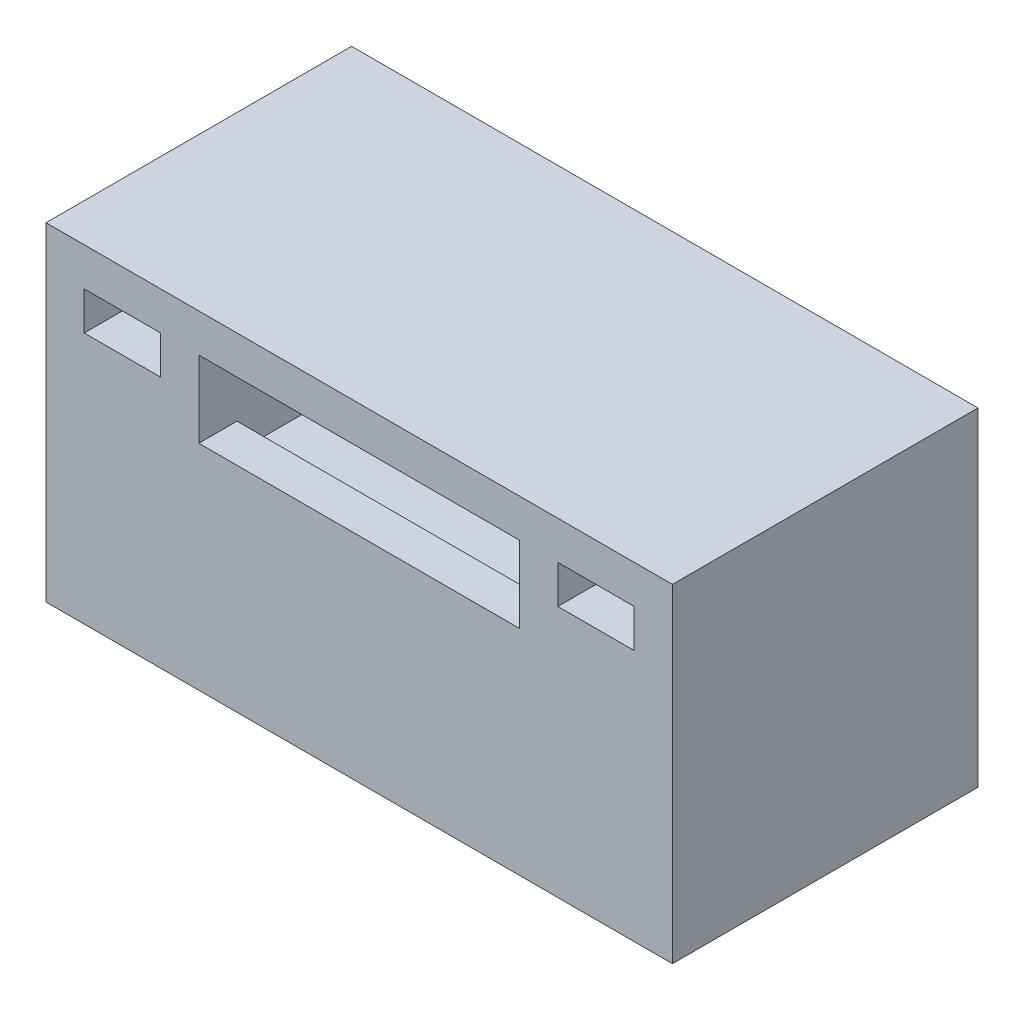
ISO-10303-21;
HEADER;
FILE_DESCRIPTION(('STEP AP214'),'2;1');
FILE_NAME('part.step','',(''),(''),'','','');
FILE_SCHEMA(('AUTOMOTIVE_DESIGN { 1 0 10303 214 1 1 1 1 }'));
ENDSEC;
DATA;
#1=APPLICATION_CONTEXT('core data for automotive mechanical design processes');
#2=APPLICATION_PROTOCOL_DEFINITION('international standard','automotive_design',2000,#1);
#3=PRODUCT_CONTEXT('',#1,'mechanical');
#4=PRODUCT('Part','Part','',(#3));
#5=PRODUCT_RELATED_PRODUCT_CATEGORY('part','',(#4));
#6=PRODUCT_DEFINITION_FORMATION('','',#4);
#7=PRODUCT_DEFINITION_CONTEXT('part definition',#1,'design');
#8=PRODUCT_DEFINITION('design','',#6,#7);
#9=PRODUCT_DEFINITION_SHAPE('','',#8);
#10=(LENGTH_UNIT() NAMED_UNIT(*) SI_UNIT(.MILLI.,.METRE.));
#11=(NAMED_UNIT(*) PLANE_ANGLE_UNIT() SI_UNIT($,.RADIAN.));
#12=(NAMED_UNIT(*) SI_UNIT($,.STERADIAN.) SOLID_ANGLE_UNIT());
#13=UNCERTAINTY_MEASURE_WITH_UNIT(LENGTH_MEASURE(1.E-05),#10,'distance_accuracy_value','');
#14=(GEOMETRIC_REPRESENTATION_CONTEXT(3) GLOBAL_UNCERTAINTY_ASSIGNED_CONTEXT((#13)) GLOBAL_UNIT_ASSIGNED_CONTEXT((#10,
#11,#12)) REPRESENTATION_CONTEXT('',''));
#15=CARTESIAN_POINT('',(0.,0.,0.));
#16=DIRECTION('',(0.,0.,1.));
#17=DIRECTION('',(1.,0.,0.));
#18=AXIS2_PLACEMENT_3D('',#15,#16,#17);
#19=CARTESIAN_POINT('',(2.1,0.300582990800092,4.));
#20=DIRECTION('',(0.,1.,0.));
#21=DIRECTION('',(-1.,0.,0.));
#22=AXIS2_PLACEMENT_3D('',#19,#20,#21);
#23=PLANE('',#22);
#24=DIRECTION('',(0.,0.,-1.));
#25=VECTOR('',#24,1.);
#26=CARTESIAN_POINT('',(-2.1,0.300582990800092,4.));
#27=LINE('',#26,#25);
#28=CARTESIAN_POINT('',(-2.1,0.300582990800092,3.5));
#29=VERTEX_POINT('',#28);
#30=CARTESIAN_POINT('',(-2.1,0.300582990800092,0.));
#31=VERTEX_POINT('',#30);
#32=EDGE_CURVE('E262',#29,#31,#27,.T.);
#33=ORIENTED_EDGE('',*,*,#32,.F.);
#34=DIRECTION('',(1.,0.,0.));
#35=VECTOR('',#34,1.);
#36=CARTESIAN_POINT('',(2.1,0.300582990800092,3.5));
#37=LINE('',#36,#35);
#38=CARTESIAN_POINT('',(2.1,0.300582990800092,3.5));
#39=VERTEX_POINT('',#38);
#40=EDGE_CURVE('E471',#29,#39,#37,.T.);
#41=ORIENTED_EDGE('',*,*,#40,.T.);
#42=DIRECTION('',(0.,0.,-1.));
#43=VECTOR('',#42,1.);
#44=CARTESIAN_POINT('',(2.1,0.300582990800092,4.));
#45=LINE('',#44,#43);
#46=CARTESIAN_POINT('',(2.1,0.300582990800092,0.));
#47=VERTEX_POINT('',#46);
#48=EDGE_CURVE('E260',#39,#47,#45,.T.);
#49=ORIENTED_EDGE('',*,*,#48,.T.);
#50=DIRECTION('',(1.,0.,0.));
#51=VECTOR('',#50,1.);
#52=CARTESIAN_POINT('',(2.1,0.300582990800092,0.));
#53=LINE('',#52,#51);
#54=EDGE_CURVE('E248',#31,#47,#53,.T.);
#55=ORIENTED_EDGE('',*,*,#54,.F.);
#56=EDGE_LOOP('',(#33,#41,#49,#55));
#57=FACE_BOUND('',#56,.T.);
#58=ADVANCED_FACE('F34',(#57),#23,.T.);
#59=CARTESIAN_POINT('',(-2.6,-0.199417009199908,4.));
#60=DIRECTION('',(-1.,0.,0.));
#61=DIRECTION('',(0.,0.,1.));
#62=AXIS2_PLACEMENT_3D('',#59,#60,#61);
#63=PLANE('',#62);
#64=DIRECTION('',(0.,0.,-1.));
#65=VECTOR('',#64,1.);
#66=CARTESIAN_POINT('',(-2.6,-0.199417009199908,4.));
#67=LINE('',#66,#65);
#68=CARTESIAN_POINT('',(-2.6,-0.199417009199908,3.5));
#69=VERTEX_POINT('',#68);
#70=CARTESIAN_POINT('',(-2.6,-0.199417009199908,0.));
#71=VERTEX_POINT('',#70);
#72=EDGE_CURVE('E517',#69,#71,#67,.T.);
#73=ORIENTED_EDGE('',*,*,#72,.F.);
#74=DIRECTION('',(0.,1.,0.));
#75=VECTOR('',#74,1.);
#76=CARTESIAN_POINT('',(-2.6,-0.199417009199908,3.5));
#77=LINE('',#76,#75);
#78=CARTESIAN_POINT('',(-2.6,0.65,3.5));
#79=VERTEX_POINT('',#78);
#80=EDGE_CURVE('E488',#69,#79,#77,.T.);
#81=ORIENTED_EDGE('',*,*,#80,.T.);
#82=DIRECTION('',(0.,0.,-1.));
#83=VECTOR('',#82,1.);
#84=CARTESIAN_POINT('',(-2.6,0.65,4.));
#85=LINE('',#84,#83);
#86=CARTESIAN_POINT('',(-2.6,0.65,0.));
#87=VERTEX_POINT('',#86);
#88=EDGE_CURVE('E231',#79,#87,#85,.T.);
#89=ORIENTED_EDGE('',*,*,#88,.T.);
#90=DIRECTION('',(0.,1.,0.));
#91=VECTOR('',#90,1.);
#92=CARTESIAN_POINT('',(-2.6,-0.199417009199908,0.));
#93=LINE('',#92,#91);
#94=EDGE_CURVE('E496',#71,#87,#93,.T.);
#95=ORIENTED_EDGE('',*,*,#94,.F.);
#96=EDGE_LOOP('',(#73,#81,#89,#95));
#97=FACE_BOUND('',#96,.T.);
#98=ADVANCED_FACE('F413',(#97),#63,.T.);
#99=CARTESIAN_POINT('',(-2.6,0.65,4.));
#100=DIRECTION('',(0.,-1.,0.));
#101=DIRECTION('',(1.,0.,0.));
#102=AXIS2_PLACEMENT_3D('',#99,#100,#101);
#103=PLANE('',#102);
#104=ORIENTED_EDGE('',*,*,#88,.F.);
#105=DIRECTION('',(-1.,0.,0.));
#106=VECTOR('',#105,1.);
#107=CARTESIAN_POINT('',(-3.6,0.65,3.5));
#108=LINE('',#107,#106);
#109=CARTESIAN_POINT('',(-3.6,0.65,3.5));
#110=VERTEX_POINT('',#109);
#111=EDGE_CURVE('E479',#79,#110,#108,.T.);
#112=ORIENTED_EDGE('',*,*,#111,.T.);
#113=DIRECTION('',(0.,0.,-1.));
#114=VECTOR('',#113,1.);
#115=CARTESIAN_POINT('',(-3.6,0.65,4.));
#116=LINE('',#115,#114);
#117=CARTESIAN_POINT('',(-3.6,0.65,0.));
#118=VERTEX_POINT('',#117);
#119=EDGE_CURVE('E222',#110,#118,#116,.T.);
#120=ORIENTED_EDGE('',*,*,#119,.T.);
#121=DIRECTION('',(-1.,0.,0.));
#122=VECTOR('',#121,1.);
#123=CARTESIAN_POINT('',(-2.6,0.65,0.));
#124=LINE('',#123,#122);
#125=EDGE_CURVE('E499',#87,#118,#124,.T.);
#126=ORIENTED_EDGE('',*,*,#125,.F.);
#127=EDGE_LOOP('',(#104,#112,#120,#126));
#128=FACE_BOUND('',#127,.T.);
#129=ADVANCED_FACE('F419',(#128),#103,.T.);
#130=CARTESIAN_POINT('',(-3.6,0.65,4.));
#131=DIRECTION('',(1.,0.,0.));
#132=DIRECTION('',(0.,1.,0.));
#133=AXIS2_PLACEMENT_3D('',#130,#131,#132);
#134=PLANE('',#133);
#135=ORIENTED_EDGE('',*,*,#119,.F.);
#136=DIRECTION('',(0.,-1.,0.));
#137=VECTOR('',#136,1.);
#138=CARTESIAN_POINT('',(-3.6,0.65,3.5));
#139=LINE('',#138,#137);
#140=CARTESIAN_POINT('',(-3.6,-1.65,3.5));
#141=VERTEX_POINT('',#140);
#142=EDGE_CURVE('E208',#110,#141,#139,.T.);
#143=ORIENTED_EDGE('',*,*,#142,.T.);
#144=DIRECTION('',(0.,0.,-1.));
#145=VECTOR('',#144,1.);
#146=CARTESIAN_POINT('',(-3.6,-1.65,4.));
#147=LINE('',#146,#145);
#148=CARTESIAN_POINT('',(-3.6,-1.65,0.));
#149=VERTEX_POINT('',#148);
#150=EDGE_CURVE('E220',#141,#149,#147,.T.);
#151=ORIENTED_EDGE('',*,*,#150,.T.);
#152=DIRECTION('',(0.,-1.,0.));
#153=VECTOR('',#152,1.);
#154=CARTESIAN_POINT('',(-3.6,0.65,0.));
#155=LINE('',#154,#153);
#156=EDGE_CURVE('E502',#118,#149,#155,.T.);
#157=ORIENTED_EDGE('',*,*,#156,.F.);
#158=EDGE_LOOP('',(#135,#143,#151,#157));
#159=FACE_BOUND('',#158,.T.);
#160=ADVANCED_FACE('F218',(#159),#134,.T.);
#161=CARTESIAN_POINT('',(-3.6,-1.65,4.));
#162=DIRECTION('',(0.,1.,0.));
#163=DIRECTION('',(-1.,0.,0.));
#164=AXIS2_PLACEMENT_3D('',#161,#162,#163);
#165=PLANE('',#164);
#166=ORIENTED_EDGE('',*,*,#150,.F.);
#167=DIRECTION('',(1.,0.,0.));
#168=VECTOR('',#167,1.);
#169=CARTESIAN_POINT('',(-3.6,-1.65,3.5));
#170=LINE('',#169,#168);
#171=CARTESIAN_POINT('',(3.6,-1.65,3.5));
#172=VERTEX_POINT('',#171);
#173=EDGE_CURVE('E205',#141,#172,#170,.T.);
#174=ORIENTED_EDGE('',*,*,#173,.T.);
#175=DIRECTION('',(0.,0.,-1.));
#176=VECTOR('',#175,1.);
#177=CARTESIAN_POINT('',(3.6,-1.65,4.));
#178=LINE('',#177,#176);
#179=CARTESIAN_POINT('',(3.6,-1.65,0.));
#180=VERTEX_POINT('',#179);
#181=EDGE_CURVE('E229',#172,#180,#178,.T.);
#182=ORIENTED_EDGE('',*,*,#181,.T.);
#183=DIRECTION('',(1.,0.,0.));
#184=VECTOR('',#183,1.);
#185=CARTESIAN_POINT('',(-3.6,-1.65,0.));
#186=LINE('',#185,#184);
#187=EDGE_CURVE('E227',#149,#180,#186,.T.);
#188=ORIENTED_EDGE('',*,*,#187,.F.);
#189=EDGE_LOOP('',(#166,#174,#182,#188));
#190=FACE_BOUND('',#189,.T.);
#191=ADVANCED_FACE('F225',(#190),#165,.T.);
#192=CARTESIAN_POINT('',(3.6,0.65,4.));
#193=DIRECTION('',(-1.,0.,0.));
#194=DIRECTION('',(0.,-1.,0.));
#195=AXIS2_PLACEMENT_3D('',#192,#193,#194);
#196=PLANE('',#195);
#197=ORIENTED_EDGE('',*,*,#181,.F.);
#198=DIRECTION('',(0.,1.,0.));
#199=VECTOR('',#198,1.);
#200=CARTESIAN_POINT('',(3.6,0.65,3.5));
#201=LINE('',#200,#199);
#202=CARTESIAN_POINT('',(3.6,0.65,3.5));
#203=VERTEX_POINT('',#202);
#204=EDGE_CURVE('E211',#172,#203,#201,.T.);
#205=ORIENTED_EDGE('',*,*,#204,.T.);
#206=DIRECTION('',(0.,0.,-1.));
#207=VECTOR('',#206,1.);
#208=CARTESIAN_POINT('',(3.6,0.65,4.));
#209=LINE('',#208,#207);
#210=CARTESIAN_POINT('',(3.6,0.65,0.));
#211=VERTEX_POINT('',#210);
#212=EDGE_CURVE('E233',#203,#211,#209,.T.);
#213=ORIENTED_EDGE('',*,*,#212,.T.);
#214=DIRECTION('',(0.,1.,0.));
#215=VECTOR('',#214,1.);
#216=CARTESIAN_POINT('',(3.6,0.65,0.));
#217=LINE('',#216,#215);
#218=EDGE_CURVE('E505',#180,#211,#217,.T.);
#219=ORIENTED_EDGE('',*,*,#218,.F.);
#220=EDGE_LOOP('',(#197,#205,#213,#219));
#221=FACE_BOUND('',#220,.T.);
#222=ADVANCED_FACE('F438',(#221),#196,.T.);
#223=CARTESIAN_POINT('',(2.6,0.65,4.));
#224=DIRECTION('',(0.,-1.,0.));
#225=DIRECTION('',(1.,0.,0.));
#226=AXIS2_PLACEMENT_3D('',#223,#224,#225);
#227=PLANE('',#226);
#228=ORIENTED_EDGE('',*,*,#212,.F.);
#229=CARTESIAN_POINT('',(2.6,0.65,3.5));
#230=VERTEX_POINT('',#229);
#231=EDGE_CURVE('E478',#203,#230,#108,.T.);
#232=ORIENTED_EDGE('',*,*,#231,.T.);
#233=DIRECTION('',(0.,0.,-1.));
#234=VECTOR('',#233,1.);
#235=CARTESIAN_POINT('',(2.6,0.65,4.));
#236=LINE('',#235,#234);
#237=CARTESIAN_POINT('',(2.6,0.65,0.));
#238=VERTEX_POINT('',#237);
#239=EDGE_CURVE('E521',#230,#238,#236,.T.);
#240=ORIENTED_EDGE('',*,*,#239,.T.);
#241=DIRECTION('',(-1.,0.,0.));
#242=VECTOR('',#241,1.);
#243=CARTESIAN_POINT('',(2.6,0.65,0.));
#244=LINE('',#243,#242);
#245=EDGE_CURVE('E508',#211,#238,#244,.T.);
#246=ORIENTED_EDGE('',*,*,#245,.F.);
#247=EDGE_LOOP('',(#228,#232,#240,#246));
#248=FACE_BOUND('',#247,.T.);
#249=ADVANCED_FACE('F441',(#248),#227,.T.);
#250=CARTESIAN_POINT('',(2.6,-0.199417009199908,4.));
#251=DIRECTION('',(1.,0.,0.));
#252=DIRECTION('',(0.,0.,-1.));
#253=AXIS2_PLACEMENT_3D('',#250,#251,#252);
#254=PLANE('',#253);
#255=ORIENTED_EDGE('',*,*,#239,.F.);
#256=DIRECTION('',(0.,-1.,0.));
#257=VECTOR('',#256,1.);
#258=CARTESIAN_POINT('',(2.6,-0.199417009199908,3.5));
#259=LINE('',#258,#257);
#260=CARTESIAN_POINT('',(2.6,-0.199417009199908,3.5));
#261=VERTEX_POINT('',#260);
#262=EDGE_CURVE('E482',#230,#261,#259,.T.);
#263=ORIENTED_EDGE('',*,*,#262,.T.);
#264=DIRECTION('',(0.,0.,-1.));
#265=VECTOR('',#264,1.);
#266=CARTESIAN_POINT('',(2.6,-0.199417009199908,4.));
#267=LINE('',#266,#265);
#268=CARTESIAN_POINT('',(2.6,-0.199417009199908,0.));
#269=VERTEX_POINT('',#268);
#270=EDGE_CURVE('E519',#261,#269,#267,.T.);
#271=ORIENTED_EDGE('',*,*,#270,.T.);
#272=DIRECTION('',(0.,-1.,0.));
#273=VECTOR('',#272,1.);
#274=CARTESIAN_POINT('',(2.6,-0.199417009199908,0.));
#275=LINE('',#274,#273);
#276=EDGE_CURVE('E511',#238,#269,#275,.T.);
#277=ORIENTED_EDGE('',*,*,#276,.F.);
#278=EDGE_LOOP('',(#255,#263,#271,#277));
#279=FACE_BOUND('',#278,.T.);
#280=ADVANCED_FACE('F445',(#279),#254,.T.);
#281=CARTESIAN_POINT('',(2.6,-0.199417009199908,4.));
#282=DIRECTION('',(0.,-1.,0.));
#283=DIRECTION('',(1.,0.,0.));
#284=AXIS2_PLACEMENT_3D('',#281,#282,#283);
#285=PLANE('',#284);
#286=ORIENTED_EDGE('',*,*,#270,.F.);
#287=DIRECTION('',(-1.,0.,0.));
#288=VECTOR('',#287,1.);
#289=CARTESIAN_POINT('',(2.6,-0.199417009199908,3.5));
#290=LINE('',#289,#288);
#291=EDGE_CURVE('E11',#261,#69,#290,.T.);
#292=ORIENTED_EDGE('',*,*,#291,.T.);
#293=ORIENTED_EDGE('',*,*,#72,.T.);
#294=DIRECTION('',(-1.,0.,0.));
#295=VECTOR('',#294,1.);
#296=CARTESIAN_POINT('',(2.6,-0.199417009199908,0.));
#297=LINE('',#296,#295);
#298=EDGE_CURVE('E514',#269,#71,#297,.T.);
#299=ORIENTED_EDGE('',*,*,#298,.F.);
#300=EDGE_LOOP('',(#286,#292,#293,#299));
#301=FACE_BOUND('',#300,.T.);
#302=ADVANCED_FACE('F377',(#301),#285,.T.);
#303=CARTESIAN_POINT('',(0.,0.,4.));
#304=DIRECTION('',(0.,0.,1.));
#305=DIRECTION('',(1.,0.,0.));
#306=AXIS2_PLACEMENT_3D('',#303,#304,#305);
#307=PLANE('',#306);
#308=DIRECTION('',(0.,1.,0.));
#309=VECTOR('',#308,1.);
#310=CARTESIAN_POINT('',(2.1,1.65,4.));
#311=LINE('',#310,#309);
#312=CARTESIAN_POINT('',(2.1,0.65,4.));
#313=VERTEX_POINT('',#312);
#314=CARTESIAN_POINT('',(2.1,1.65,4.));
#315=VERTEX_POINT('',#314);
#316=EDGE_CURVE('E240',#313,#315,#311,.T.);
#317=ORIENTED_EDGE('',*,*,#316,.F.);
#318=DIRECTION('',(-1.,0.,0.));
#319=VECTOR('',#318,1.);
#320=CARTESIAN_POINT('',(-3.6,0.65,4.));
#321=LINE('',#320,#319);
#322=CARTESIAN_POINT('',(-2.1,0.65,4.));
#323=VERTEX_POINT('',#322);
#324=EDGE_CURVE('E223',#313,#323,#321,.T.);
#325=ORIENTED_EDGE('',*,*,#324,.T.);
#326=DIRECTION('',(0.,-1.,0.));
#327=VECTOR('',#326,1.);
#328=CARTESIAN_POINT('',(-2.1,1.65,4.));
#329=LINE('',#328,#327);
#330=CARTESIAN_POINT('',(-2.1,1.65,4.));
#331=VERTEX_POINT('',#330);
#332=EDGE_CURVE('E54',#331,#323,#329,.T.);
#333=ORIENTED_EDGE('',*,*,#332,.F.);
#334=DIRECTION('',(-1.,0.,0.));
#335=VECTOR('',#334,1.);
#336=CARTESIAN_POINT('',(2.1,1.65,4.));
#337=LINE('',#336,#335);
#338=EDGE_CURVE('E243',#315,#331,#337,.T.);
#339=ORIENTED_EDGE('',*,*,#338,.F.);
#340=EDGE_LOOP('',(#317,#325,#333,#339));
#341=FACE_BOUND('',#340,.T.);
#342=DIRECTION('',(0.,1.,0.));
#343=VECTOR('',#342,1.);
#344=CARTESIAN_POINT('',(4.1,2.15,4.));
#345=LINE('',#344,#343);
#346=CARTESIAN_POINT('',(4.1,-2.15,4.));
#347=VERTEX_POINT('',#346);
#348=CARTESIAN_POINT('',(4.1,2.15,4.));
#349=VERTEX_POINT('',#348);
#350=EDGE_CURVE('E327',#347,#349,#345,.T.);
#351=ORIENTED_EDGE('',*,*,#350,.T.);
#352=DIRECTION('',(-1.,0.,0.));
#353=VECTOR('',#352,1.);
#354=CARTESIAN_POINT('',(-4.1,2.15,4.));
#355=LINE('',#354,#353);
#356=CARTESIAN_POINT('',(-4.1,2.15,4.));
#357=VERTEX_POINT('',#356);
#358=EDGE_CURVE('E330',#349,#357,#355,.T.);
#359=ORIENTED_EDGE('',*,*,#358,.T.);
#360=DIRECTION('',(0.,-1.,0.));
#361=VECTOR('',#360,1.);
#362=CARTESIAN_POINT('',(-4.1,2.15,4.));
#363=LINE('',#362,#361);
#364=CARTESIAN_POINT('',(-4.1,-2.15,4.));
#365=VERTEX_POINT('',#364);
#366=EDGE_CURVE('E333',#357,#365,#363,.T.);
#367=ORIENTED_EDGE('',*,*,#366,.T.);
#368=DIRECTION('',(1.,0.,0.));
#369=VECTOR('',#368,1.);
#370=CARTESIAN_POINT('',(-4.1,-2.15,4.));
#371=LINE('',#370,#369);
#372=EDGE_CURVE('E335',#365,#347,#371,.T.);
#373=ORIENTED_EDGE('',*,*,#372,.T.);
#374=EDGE_LOOP('',(#351,#359,#367,#373));
#375=FACE_BOUND('',#374,.T.);
#376=DIRECTION('',(1.,0.,0.));
#377=VECTOR('',#376,1.);
#378=CARTESIAN_POINT('',(-3.6,1.15,4.));
#379=LINE('',#378,#377);
#380=CARTESIAN_POINT('',(-3.6,1.15,4.));
#381=VERTEX_POINT('',#380);
#382=CARTESIAN_POINT('',(-2.6,1.15,4.));
#383=VERTEX_POINT('',#382);
#384=EDGE_CURVE('E298',#381,#383,#379,.T.);
#385=ORIENTED_EDGE('',*,*,#384,.F.);
#386=DIRECTION('',(0.,-1.,0.));
#387=VECTOR('',#386,1.);
#388=CARTESIAN_POINT('',(-3.6,1.65,4.));
#389=LINE('',#388,#387);
#390=CARTESIAN_POINT('',(-3.6,1.65,4.));
#391=VERTEX_POINT('',#390);
#392=EDGE_CURVE('E296',#391,#381,#389,.T.);
#393=ORIENTED_EDGE('',*,*,#392,.F.);
#394=DIRECTION('',(-1.,0.,0.));
#395=VECTOR('',#394,1.);
#396=CARTESIAN_POINT('',(-3.6,1.65,4.));
#397=LINE('',#396,#395);
#398=CARTESIAN_POINT('',(-2.6,1.65,4.));
#399=VERTEX_POINT('',#398);
#400=EDGE_CURVE('E304',#399,#391,#397,.T.);
#401=ORIENTED_EDGE('',*,*,#400,.F.);
#402=DIRECTION('',(0.,1.,0.));
#403=VECTOR('',#402,1.);
#404=CARTESIAN_POINT('',(-2.6,1.65,4.));
#405=LINE('',#404,#403);
#406=EDGE_CURVE('E301',#383,#399,#405,.T.);
#407=ORIENTED_EDGE('',*,*,#406,.F.);
#408=EDGE_LOOP('',(#385,#393,#401,#407));
#409=FACE_BOUND('',#408,.T.);
#410=DIRECTION('',(0.,-1.,0.));
#411=VECTOR('',#410,1.);
#412=CARTESIAN_POINT('',(2.6,1.65,4.));
#413=LINE('',#412,#411);
#414=CARTESIAN_POINT('',(2.6,1.65,4.));
#415=VERTEX_POINT('',#414);
#416=CARTESIAN_POINT('',(2.6,1.15,4.));
#417=VERTEX_POINT('',#416);
#418=EDGE_CURVE('E267',#415,#417,#413,.T.);
#419=ORIENTED_EDGE('',*,*,#418,.F.);
#420=DIRECTION('',(-1.,0.,0.));
#421=VECTOR('',#420,1.);
#422=CARTESIAN_POINT('',(3.6,1.65,4.));
#423=LINE('',#422,#421);
#424=CARTESIAN_POINT('',(3.6,1.65,4.));
#425=VERTEX_POINT('',#424);
#426=EDGE_CURVE('E265',#425,#415,#423,.T.);
#427=ORIENTED_EDGE('',*,*,#426,.F.);
#428=DIRECTION('',(0.,1.,0.));
#429=VECTOR('',#428,1.);
#430=CARTESIAN_POINT('',(3.6,1.65,4.));
#431=LINE('',#430,#429);
#432=CARTESIAN_POINT('',(3.6,1.15,4.));
#433=VERTEX_POINT('',#432);
#434=EDGE_CURVE('E273',#433,#425,#431,.T.);
#435=ORIENTED_EDGE('',*,*,#434,.F.);
#436=DIRECTION('',(1.,0.,0.));
#437=VECTOR('',#436,1.);
#438=CARTESIAN_POINT('',(3.6,1.15,4.));
#439=LINE('',#438,#437);
#440=EDGE_CURVE('E270',#417,#433,#439,.T.);
#441=ORIENTED_EDGE('',*,*,#440,.F.);
#442=EDGE_LOOP('',(#419,#427,#435,#441));
#443=FACE_BOUND('',#442,.T.);
#444=ADVANCED_FACE('F374',(#341,#375,#409,#443),#307,.T.);
#445=CARTESIAN_POINT('',(0.,0.,0.));
#446=DIRECTION('',(0.,0.,1.));
#447=DIRECTION('',(1.,0.,0.));
#448=AXIS2_PLACEMENT_3D('',#445,#446,#447);
#449=PLANE('',#448);
#450=DIRECTION('',(0.,-1.,0.));
#451=VECTOR('',#450,1.);
#452=CARTESIAN_POINT('',(-2.1,1.65,0.));
#453=LINE('',#452,#451);
#454=CARTESIAN_POINT('',(-2.1,1.65,0.));
#455=VERTEX_POINT('',#454);
#456=EDGE_CURVE('E238',#455,#31,#453,.T.);
#457=ORIENTED_EDGE('',*,*,#456,.T.);
#458=ORIENTED_EDGE('',*,*,#54,.T.);
#459=DIRECTION('',(0.,1.,0.));
#460=VECTOR('',#459,1.);
#461=CARTESIAN_POINT('',(2.1,1.65,0.));
#462=LINE('',#461,#460);
#463=CARTESIAN_POINT('',(2.1,1.65,0.));
#464=VERTEX_POINT('',#463);
#465=EDGE_CURVE('E251',#47,#464,#462,.T.);
#466=ORIENTED_EDGE('',*,*,#465,.T.);
#467=DIRECTION('',(-1.,0.,0.));
#468=VECTOR('',#467,1.);
#469=CARTESIAN_POINT('',(2.1,1.65,0.));
#470=LINE('',#469,#468);
#471=EDGE_CURVE('E241',#464,#455,#470,.T.);
#472=ORIENTED_EDGE('',*,*,#471,.T.);
#473=EDGE_LOOP('',(#457,#458,#466,#472));
#474=FACE_BOUND('',#473,.T.);
#475=DIRECTION('',(0.,-1.,0.));
#476=VECTOR('',#475,1.);
#477=CARTESIAN_POINT('',(-3.6,1.65,0.));
#478=LINE('',#477,#476);
#479=CARTESIAN_POINT('',(-3.6,1.65,0.));
#480=VERTEX_POINT('',#479);
#481=CARTESIAN_POINT('',(-3.6,1.15,0.));
#482=VERTEX_POINT('',#481);
#483=EDGE_CURVE('E295',#480,#482,#478,.T.);
#484=ORIENTED_EDGE('',*,*,#483,.T.);
#485=DIRECTION('',(1.,0.,0.));
#486=VECTOR('',#485,1.);
#487=CARTESIAN_POINT('',(-3.6,1.15,0.));
#488=LINE('',#487,#486);
#489=CARTESIAN_POINT('',(-2.6,1.15,0.));
#490=VERTEX_POINT('',#489);
#491=EDGE_CURVE('E309',#482,#490,#488,.T.);
#492=ORIENTED_EDGE('',*,*,#491,.T.);
#493=DIRECTION('',(0.,1.,0.));
#494=VECTOR('',#493,1.);
#495=CARTESIAN_POINT('',(-2.6,1.65,0.));
#496=LINE('',#495,#494);
#497=CARTESIAN_POINT('',(-2.6,1.65,0.));
#498=VERTEX_POINT('',#497);
#499=EDGE_CURVE('E312',#490,#498,#496,.T.);
#500=ORIENTED_EDGE('',*,*,#499,.T.);
#501=DIRECTION('',(-1.,0.,0.));
#502=VECTOR('',#501,1.);
#503=CARTESIAN_POINT('',(-3.6,1.65,0.));
#504=LINE('',#503,#502);
#505=EDGE_CURVE('E299',#498,#480,#504,.T.);
#506=ORIENTED_EDGE('',*,*,#505,.T.);
#507=EDGE_LOOP('',(#484,#492,#500,#506));
#508=FACE_BOUND('',#507,.T.);
#509=DIRECTION('',(0.,1.,0.));
#510=VECTOR('',#509,1.);
#511=CARTESIAN_POINT('',(4.1,2.15,0.));
#512=LINE('',#511,#510);
#513=CARTESIAN_POINT('',(4.1,-2.15,0.));
#514=VERTEX_POINT('',#513);
#515=CARTESIAN_POINT('',(4.1,2.15,0.));
#516=VERTEX_POINT('',#515);
#517=EDGE_CURVE('E326',#514,#516,#512,.T.);
#518=ORIENTED_EDGE('',*,*,#517,.F.);
#519=DIRECTION('',(1.,0.,0.));
#520=VECTOR('',#519,1.);
#521=CARTESIAN_POINT('',(-4.1,-2.15,0.));
#522=LINE('',#521,#520);
#523=CARTESIAN_POINT('',(-4.1,-2.15,0.));
#524=VERTEX_POINT('',#523);
#525=EDGE_CURVE('E331',#524,#514,#522,.T.);
#526=ORIENTED_EDGE('',*,*,#525,.F.);
#527=DIRECTION('',(0.,-1.,0.));
#528=VECTOR('',#527,1.);
#529=CARTESIAN_POINT('',(-4.1,2.15,0.));
#530=LINE('',#529,#528);
#531=CARTESIAN_POINT('',(-4.1,2.15,0.));
#532=VERTEX_POINT('',#531);
#533=EDGE_CURVE('E342',#532,#524,#530,.T.);
#534=ORIENTED_EDGE('',*,*,#533,.F.);
#535=DIRECTION('',(-1.,0.,0.));
#536=VECTOR('',#535,1.);
#537=CARTESIAN_POINT('',(-4.1,2.15,0.));
#538=LINE('',#537,#536);
#539=EDGE_CURVE('E340',#516,#532,#538,.T.);
#540=ORIENTED_EDGE('',*,*,#539,.F.);
#541=EDGE_LOOP('',(#518,#526,#534,#540));
#542=FACE_BOUND('',#541,.T.);
#543=DIRECTION('',(-1.,0.,0.));
#544=VECTOR('',#543,1.);
#545=CARTESIAN_POINT('',(3.6,1.65,0.));
#546=LINE('',#545,#544);
#547=CARTESIAN_POINT('',(3.6,1.65,0.));
#548=VERTEX_POINT('',#547);
#549=CARTESIAN_POINT('',(2.6,1.65,0.));
#550=VERTEX_POINT('',#549);
#551=EDGE_CURVE('E264',#548,#550,#546,.T.);
#552=ORIENTED_EDGE('',*,*,#551,.T.);
#553=DIRECTION('',(0.,-1.,0.));
#554=VECTOR('',#553,1.);
#555=CARTESIAN_POINT('',(2.6,1.65,0.));
#556=LINE('',#555,#554);
#557=CARTESIAN_POINT('',(2.6,1.15,0.));
#558=VERTEX_POINT('',#557);
#559=EDGE_CURVE('E278',#550,#558,#556,.T.);
#560=ORIENTED_EDGE('',*,*,#559,.T.);
#561=DIRECTION('',(1.,0.,0.));
#562=VECTOR('',#561,1.);
#563=CARTESIAN_POINT('',(3.6,1.15,0.));
#564=LINE('',#563,#562);
#565=CARTESIAN_POINT('',(3.6,1.15,0.));
#566=VERTEX_POINT('',#565);
#567=EDGE_CURVE('E281',#558,#566,#564,.T.);
#568=ORIENTED_EDGE('',*,*,#567,.T.);
#569=DIRECTION('',(0.,1.,0.));
#570=VECTOR('',#569,1.);
#571=CARTESIAN_POINT('',(3.6,1.65,0.));
#572=LINE('',#571,#570);
#573=EDGE_CURVE('E268',#566,#548,#572,.T.);
#574=ORIENTED_EDGE('',*,*,#573,.T.);
#575=EDGE_LOOP('',(#552,#560,#568,#574));
#576=FACE_BOUND('',#575,.T.);
#577=ORIENTED_EDGE('',*,*,#94,.T.);
#578=ORIENTED_EDGE('',*,*,#125,.T.);
#579=ORIENTED_EDGE('',*,*,#156,.T.);
#580=ORIENTED_EDGE('',*,*,#187,.T.);
#581=ORIENTED_EDGE('',*,*,#218,.T.);
#582=ORIENTED_EDGE('',*,*,#245,.T.);
#583=ORIENTED_EDGE('',*,*,#276,.T.);
#584=ORIENTED_EDGE('',*,*,#298,.T.);
#585=EDGE_LOOP('',(#577,#578,#579,#580,#581,#582,#583,#584));
#586=FACE_BOUND('',#585,.T.);
#587=ADVANCED_FACE('F363',(#474,#508,#542,#576,#586),#449,.F.);
#588=CARTESIAN_POINT('',(4.1,2.15,4.));
#589=DIRECTION('',(-1.,0.,0.));
#590=DIRECTION('',(0.,0.,1.));
#591=AXIS2_PLACEMENT_3D('',#588,#589,#590);
#592=PLANE('',#591);
#593=ORIENTED_EDGE('',*,*,#517,.T.);
#594=DIRECTION('',(0.,0.,-1.));
#595=VECTOR('',#594,1.);
#596=CARTESIAN_POINT('',(4.1,2.15,4.));
#597=LINE('',#596,#595);
#598=EDGE_CURVE('E42',#349,#516,#597,.T.);
#599=ORIENTED_EDGE('',*,*,#598,.F.);
#600=ORIENTED_EDGE('',*,*,#350,.F.);
#601=DIRECTION('',(0.,0.,-1.));
#602=VECTOR('',#601,1.);
#603=CARTESIAN_POINT('',(4.1,-2.15,4.));
#604=LINE('',#603,#602);
#605=EDGE_CURVE('E337',#347,#514,#604,.T.);
#606=ORIENTED_EDGE('',*,*,#605,.T.);
#607=EDGE_LOOP('',(#593,#599,#600,#606));
#608=FACE_BOUND('',#607,.T.);
#609=ADVANCED_FACE('F36',(#608),#592,.F.);
#610=CARTESIAN_POINT('',(-4.1,2.15,4.));
#611=DIRECTION('',(0.,-1.,0.));
#612=DIRECTION('',(0.,0.,-1.));
#613=AXIS2_PLACEMENT_3D('',#610,#611,#612);
#614=PLANE('',#613);
#615=ORIENTED_EDGE('',*,*,#539,.T.);
#616=DIRECTION('',(0.,0.,-1.));
#617=VECTOR('',#616,1.);
#618=CARTESIAN_POINT('',(-4.1,2.15,4.));
#619=LINE('',#618,#617);
#620=EDGE_CURVE('E350',#357,#532,#619,.T.);
#621=ORIENTED_EDGE('',*,*,#620,.F.);
#622=ORIENTED_EDGE('',*,*,#358,.F.);
#623=ORIENTED_EDGE('',*,*,#598,.T.);
#624=EDGE_LOOP('',(#615,#621,#622,#623));
#625=FACE_BOUND('',#624,.T.);
#626=ADVANCED_FACE('F355',(#625),#614,.F.);
#627=CARTESIAN_POINT('',(-4.1,2.15,4.));
#628=DIRECTION('',(1.,0.,0.));
#629=DIRECTION('',(0.,1.,0.));
#630=AXIS2_PLACEMENT_3D('',#627,#628,#629);
#631=PLANE('',#630);
#632=ORIENTED_EDGE('',*,*,#533,.T.);
#633=DIRECTION('',(0.,0.,-1.));
#634=VECTOR('',#633,1.);
#635=CARTESIAN_POINT('',(-4.1,-2.15,4.));
#636=LINE('',#635,#634);
#637=EDGE_CURVE('E347',#365,#524,#636,.T.);
#638=ORIENTED_EDGE('',*,*,#637,.F.);
#639=ORIENTED_EDGE('',*,*,#366,.F.);
#640=ORIENTED_EDGE('',*,*,#620,.T.);
#641=EDGE_LOOP('',(#632,#638,#639,#640));
#642=FACE_BOUND('',#641,.T.);
#643=ADVANCED_FACE('F368',(#642),#631,.F.);
#644=CARTESIAN_POINT('',(-4.1,-2.15,4.));
#645=DIRECTION('',(0.,1.,0.));
#646=DIRECTION('',(0.,0.,1.));
#647=AXIS2_PLACEMENT_3D('',#644,#645,#646);
#648=PLANE('',#647);
#649=ORIENTED_EDGE('',*,*,#525,.T.);
#650=ORIENTED_EDGE('',*,*,#605,.F.);
#651=ORIENTED_EDGE('',*,*,#372,.F.);
#652=ORIENTED_EDGE('',*,*,#637,.T.);
#653=EDGE_LOOP('',(#649,#650,#651,#652));
#654=FACE_BOUND('',#653,.T.);
#655=ADVANCED_FACE('F372',(#654),#648,.F.);
#656=CARTESIAN_POINT('',(-3.6,1.65,4.));
#657=DIRECTION('',(1.,0.,0.));
#658=DIRECTION('',(0.,1.,0.));
#659=AXIS2_PLACEMENT_3D('',#656,#657,#658);
#660=PLANE('',#659);
#661=ORIENTED_EDGE('',*,*,#483,.F.);
#662=DIRECTION('',(0.,0.,-1.));
#663=VECTOR('',#662,1.);
#664=CARTESIAN_POINT('',(-3.6,1.65,4.));
#665=LINE('',#664,#663);
#666=EDGE_CURVE('E306',#391,#480,#665,.T.);
#667=ORIENTED_EDGE('',*,*,#666,.F.);
#668=ORIENTED_EDGE('',*,*,#392,.T.);
#669=DIRECTION('',(0.,0.,-1.));
#670=VECTOR('',#669,1.);
#671=CARTESIAN_POINT('',(-3.6,1.15,4.));
#672=LINE('',#671,#670);
#673=EDGE_CURVE('E323',#381,#482,#672,.T.);
#674=ORIENTED_EDGE('',*,*,#673,.T.);
#675=EDGE_LOOP('',(#661,#667,#668,#674));
#676=FACE_BOUND('',#675,.T.);
#677=ADVANCED_FACE('F544',(#676),#660,.T.);
#678=CARTESIAN_POINT('',(-3.6,1.15,4.));
#679=DIRECTION('',(0.,1.,0.));
#680=DIRECTION('',(0.,0.,1.));
#681=AXIS2_PLACEMENT_3D('',#678,#679,#680);
#682=PLANE('',#681);
#683=ORIENTED_EDGE('',*,*,#491,.F.);
#684=ORIENTED_EDGE('',*,*,#673,.F.);
#685=ORIENTED_EDGE('',*,*,#384,.T.);
#686=DIRECTION('',(0.,0.,-1.));
#687=VECTOR('',#686,1.);
#688=CARTESIAN_POINT('',(-2.6,1.15,4.));
#689=LINE('',#688,#687);
#690=EDGE_CURVE('E321',#383,#490,#689,.T.);
#691=ORIENTED_EDGE('',*,*,#690,.T.);
#692=EDGE_LOOP('',(#683,#684,#685,#691));
#693=FACE_BOUND('',#692,.T.);
#694=ADVANCED_FACE('F565',(#693),#682,.T.);
#695=CARTESIAN_POINT('',(-2.6,1.65,4.));
#696=DIRECTION('',(-1.,0.,0.));
#697=DIRECTION('',(0.,0.,1.));
#698=AXIS2_PLACEMENT_3D('',#695,#696,#697);
#699=PLANE('',#698);
#700=ORIENTED_EDGE('',*,*,#499,.F.);
#701=ORIENTED_EDGE('',*,*,#690,.F.);
#702=ORIENTED_EDGE('',*,*,#406,.T.);
#703=DIRECTION('',(0.,0.,-1.));
#704=VECTOR('',#703,1.);
#705=CARTESIAN_POINT('',(-2.6,1.65,4.));
#706=LINE('',#705,#704);
#707=EDGE_CURVE('E319',#399,#498,#706,.T.);
#708=ORIENTED_EDGE('',*,*,#707,.T.);
#709=EDGE_LOOP('',(#700,#701,#702,#708));
#710=FACE_BOUND('',#709,.T.);
#711=ADVANCED_FACE('F572',(#710),#699,.T.);
#712=CARTESIAN_POINT('',(-3.6,1.65,4.));
#713=DIRECTION('',(0.,-1.,0.));
#714=DIRECTION('',(1.,0.,0.));
#715=AXIS2_PLACEMENT_3D('',#712,#713,#714);
#716=PLANE('',#715);
#717=ORIENTED_EDGE('',*,*,#505,.F.);
#718=ORIENTED_EDGE('',*,*,#707,.F.);
#719=ORIENTED_EDGE('',*,*,#400,.T.);
#720=ORIENTED_EDGE('',*,*,#666,.T.);
#721=EDGE_LOOP('',(#717,#718,#719,#720));
#722=FACE_BOUND('',#721,.T.);
#723=ADVANCED_FACE('F580',(#722),#716,.T.);
#724=CARTESIAN_POINT('',(3.6,1.65,4.));
#725=DIRECTION('',(0.,-1.,0.));
#726=DIRECTION('',(1.,0.,0.));
#727=AXIS2_PLACEMENT_3D('',#724,#725,#726);
#728=PLANE('',#727);
#729=ORIENTED_EDGE('',*,*,#551,.F.);
#730=DIRECTION('',(0.,0.,-1.));
#731=VECTOR('',#730,1.);
#732=CARTESIAN_POINT('',(3.6,1.65,4.));
#733=LINE('',#732,#731);
#734=EDGE_CURVE('E275',#425,#548,#733,.T.);
#735=ORIENTED_EDGE('',*,*,#734,.F.);
#736=ORIENTED_EDGE('',*,*,#426,.T.);
#737=DIRECTION('',(0.,0.,-1.));
#738=VECTOR('',#737,1.);
#739=CARTESIAN_POINT('',(2.6,1.65,4.));
#740=LINE('',#739,#738);
#741=EDGE_CURVE('E292',#415,#550,#740,.T.);
#742=ORIENTED_EDGE('',*,*,#741,.T.);
#743=EDGE_LOOP('',(#729,#735,#736,#742));
#744=FACE_BOUND('',#743,.T.);
#745=ADVANCED_FACE('F398',(#744),#728,.T.);
#746=CARTESIAN_POINT('',(2.6,1.65,4.));
#747=DIRECTION('',(1.,0.,0.));
#748=DIRECTION('',(0.,0.,-1.));
#749=AXIS2_PLACEMENT_3D('',#746,#747,#748);
#750=PLANE('',#749);
#751=ORIENTED_EDGE('',*,*,#559,.F.);
#752=ORIENTED_EDGE('',*,*,#741,.F.);
#753=ORIENTED_EDGE('',*,*,#418,.T.);
#754=DIRECTION('',(0.,0.,-1.));
#755=VECTOR('',#754,1.);
#756=CARTESIAN_POINT('',(2.6,1.15,4.));
#757=LINE('',#756,#755);
#758=EDGE_CURVE('E290',#417,#558,#757,.T.);
#759=ORIENTED_EDGE('',*,*,#758,.T.);
#760=EDGE_LOOP('',(#751,#752,#753,#759));
#761=FACE_BOUND('',#760,.T.);
#762=ADVANCED_FACE('F391',(#761),#750,.T.);
#763=CARTESIAN_POINT('',(3.6,1.15,4.));
#764=DIRECTION('',(0.,1.,0.));
#765=DIRECTION('',(-1.,0.,0.));
#766=AXIS2_PLACEMENT_3D('',#763,#764,#765);
#767=PLANE('',#766);
#768=ORIENTED_EDGE('',*,*,#567,.F.);
#769=ORIENTED_EDGE('',*,*,#758,.F.);
#770=ORIENTED_EDGE('',*,*,#440,.T.);
#771=DIRECTION('',(0.,0.,-1.));
#772=VECTOR('',#771,1.);
#773=CARTESIAN_POINT('',(3.6,1.15,4.));
#774=LINE('',#773,#772);
#775=EDGE_CURVE('E288',#433,#566,#774,.T.);
#776=ORIENTED_EDGE('',*,*,#775,.T.);
#777=EDGE_LOOP('',(#768,#769,#770,#776));
#778=FACE_BOUND('',#777,.T.);
#779=ADVANCED_FACE('F394',(#778),#767,.T.);
#780=CARTESIAN_POINT('',(3.6,1.65,4.));
#781=DIRECTION('',(-1.,0.,0.));
#782=DIRECTION('',(0.,0.,1.));
#783=AXIS2_PLACEMENT_3D('',#780,#781,#782);
#784=PLANE('',#783);
#785=ORIENTED_EDGE('',*,*,#573,.F.);
#786=ORIENTED_EDGE('',*,*,#775,.F.);
#787=ORIENTED_EDGE('',*,*,#434,.T.);
#788=ORIENTED_EDGE('',*,*,#734,.T.);
#789=EDGE_LOOP('',(#785,#786,#787,#788));
#790=FACE_BOUND('',#789,.T.);
#791=ADVANCED_FACE('F401',(#790),#784,.T.);
#792=CARTESIAN_POINT('',(-2.1,1.65,4.));
#793=DIRECTION('',(1.,0.,0.));
#794=DIRECTION('',(0.,0.,-1.));
#795=AXIS2_PLACEMENT_3D('',#792,#793,#794);
#796=PLANE('',#795);
#797=DIRECTION('',(0.,0.,1.));
#798=VECTOR('',#797,1.);
#799=CARTESIAN_POINT('',(-2.1,0.65,4.));
#800=LINE('',#799,#798);
#801=CARTESIAN_POINT('',(-2.1,0.65,3.5));
#802=VERTEX_POINT('',#801);
#803=EDGE_CURVE('E49',#802,#323,#800,.T.);
#804=ORIENTED_EDGE('',*,*,#803,.F.);
#805=DIRECTION('',(0.,-1.,0.));
#806=VECTOR('',#805,1.);
#807=CARTESIAN_POINT('',(-2.1,1.65,3.5));
#808=LINE('',#807,#806);
#809=EDGE_CURVE('E467',#802,#29,#808,.T.);
#810=ORIENTED_EDGE('',*,*,#809,.T.);
#811=ORIENTED_EDGE('',*,*,#32,.T.);
#812=ORIENTED_EDGE('',*,*,#456,.F.);
#813=DIRECTION('',(0.,0.,-1.));
#814=VECTOR('',#813,1.);
#815=CARTESIAN_POINT('',(-2.1,1.65,4.));
#816=LINE('',#815,#814);
#817=EDGE_CURVE('E245',#331,#455,#816,.T.);
#818=ORIENTED_EDGE('',*,*,#817,.F.);
#819=ORIENTED_EDGE('',*,*,#332,.T.);
#820=EDGE_LOOP('',(#804,#810,#811,#812,#818,#819));
#821=FACE_BOUND('',#820,.T.);
#822=ADVANCED_FACE('F403',(#821),#796,.T.);
#823=CARTESIAN_POINT('',(2.1,1.65,4.));
#824=DIRECTION('',(-1.,0.,0.));
#825=DIRECTION('',(0.,0.,1.));
#826=AXIS2_PLACEMENT_3D('',#823,#824,#825);
#827=PLANE('',#826);
#828=DIRECTION('',(0.,0.,-1.));
#829=VECTOR('',#828,1.);
#830=CARTESIAN_POINT('',(2.1,0.65,4.));
#831=LINE('',#830,#829);
#832=CARTESIAN_POINT('',(2.1,0.65,3.5));
#833=VERTEX_POINT('',#832);
#834=EDGE_CURVE('E472',#313,#833,#831,.T.);
#835=ORIENTED_EDGE('',*,*,#834,.F.);
#836=ORIENTED_EDGE('',*,*,#316,.T.);
#837=DIRECTION('',(0.,0.,-1.));
#838=VECTOR('',#837,1.);
#839=CARTESIAN_POINT('',(2.1,1.65,4.));
#840=LINE('',#839,#838);
#841=EDGE_CURVE('E258',#315,#464,#840,.T.);
#842=ORIENTED_EDGE('',*,*,#841,.T.);
#843=ORIENTED_EDGE('',*,*,#465,.F.);
#844=ORIENTED_EDGE('',*,*,#48,.F.);
#845=DIRECTION('',(0.,1.,0.));
#846=VECTOR('',#845,1.);
#847=CARTESIAN_POINT('',(2.1,1.65,3.5));
#848=LINE('',#847,#846);
#849=EDGE_CURVE('E491',#39,#833,#848,.T.);
#850=ORIENTED_EDGE('',*,*,#849,.T.);
#851=EDGE_LOOP('',(#835,#836,#842,#843,#844,#850));
#852=FACE_BOUND('',#851,.T.);
#853=ADVANCED_FACE('F409',(#852),#827,.T.);
#854=CARTESIAN_POINT('',(2.1,1.65,4.));
#855=DIRECTION('',(0.,-1.,0.));
#856=DIRECTION('',(1.,0.,0.));
#857=AXIS2_PLACEMENT_3D('',#854,#855,#856);
#858=PLANE('',#857);
#859=ORIENTED_EDGE('',*,*,#471,.F.);
#860=ORIENTED_EDGE('',*,*,#841,.F.);
#861=ORIENTED_EDGE('',*,*,#338,.T.);
#862=ORIENTED_EDGE('',*,*,#817,.T.);
#863=EDGE_LOOP('',(#859,#860,#861,#862));
#864=FACE_BOUND('',#863,.T.);
#865=ADVANCED_FACE('F426',(#864),#858,.T.);
#866=CARTESIAN_POINT('',(0.,0.,3.5));
#867=DIRECTION('',(0.,0.,1.));
#868=DIRECTION('',(1.,0.,0.));
#869=AXIS2_PLACEMENT_3D('',#866,#867,#868);
#870=PLANE('',#869);
#871=ORIENTED_EDGE('',*,*,#80,.F.);
#872=ORIENTED_EDGE('',*,*,#291,.F.);
#873=ORIENTED_EDGE('',*,*,#262,.F.);
#874=ORIENTED_EDGE('',*,*,#231,.F.);
#875=ORIENTED_EDGE('',*,*,#204,.F.);
#876=ORIENTED_EDGE('',*,*,#173,.F.);
#877=ORIENTED_EDGE('',*,*,#142,.F.);
#878=ORIENTED_EDGE('',*,*,#111,.F.);
#879=EDGE_LOOP('',(#871,#872,#873,#874,#875,#876,#877,#878));
#880=FACE_BOUND('',#879,.T.);
#881=ADVANCED_FACE('F207',(#880),#870,.F.);
#882=CARTESIAN_POINT('',(-3.6,0.65,3.5));
#883=DIRECTION('',(0.,1.,0.));
#884=DIRECTION('',(0.,0.,1.));
#885=AXIS2_PLACEMENT_3D('',#882,#883,#884);
#886=PLANE('',#885);
#887=EDGE_CURVE('E470',#833,#802,#108,.T.);
#888=ORIENTED_EDGE('',*,*,#887,.T.);
#889=ORIENTED_EDGE('',*,*,#803,.T.);
#890=ORIENTED_EDGE('',*,*,#324,.F.);
#891=ORIENTED_EDGE('',*,*,#834,.T.);
#892=EDGE_LOOP('',(#888,#889,#890,#891));
#893=FACE_BOUND('',#892,.T.);
#894=ADVANCED_FACE('F453',(#893),#886,.T.);
#895=ORIENTED_EDGE('',*,*,#809,.F.);
#896=ORIENTED_EDGE('',*,*,#887,.F.);
#897=ORIENTED_EDGE('',*,*,#849,.F.);
#898=ORIENTED_EDGE('',*,*,#40,.F.);
#899=EDGE_LOOP('',(#895,#896,#897,#898));
#900=FACE_BOUND('',#899,.T.);
#901=ADVANCED_FACE('F456',(#900),#870,.F.);
#902=CLOSED_SHELL('',(#58,#98,#129,#160,#191,#222,#249,#280,#302,#444,#587,#609,#626,#643,#655,
#677,#694,#711,#723,#745,#762,#779,#791,#822,#853,#865,#881,#894,#901));
#903=MANIFOLD_SOLID_BREP('B2',#902);
#904=ADVANCED_BREP_SHAPE_REPRESENTATION('',(#18,#903),#14);
#905=SHAPE_DEFINITION_REPRESENTATION(#9,#904);
ENDSEC;
END-ISO-10303-21;
